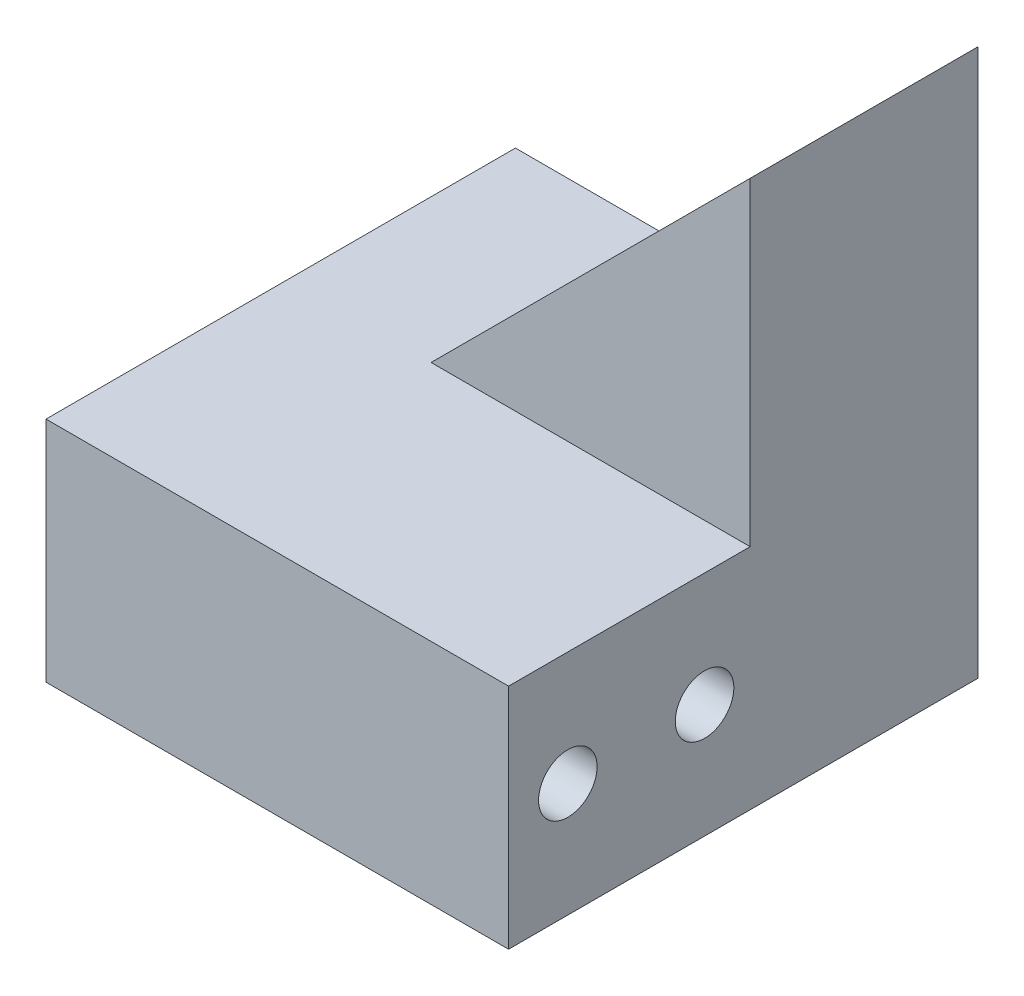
ISO-10303-21;
HEADER;
FILE_DESCRIPTION(('STEP AP214'),'2;1');
FILE_NAME('part.step','',(''),(''),'','','');
FILE_SCHEMA(('AUTOMOTIVE_DESIGN { 1 0 10303 214 1 1 1 1 }'));
ENDSEC;
DATA;
#1=APPLICATION_CONTEXT('core data for automotive mechanical design processes');
#2=APPLICATION_PROTOCOL_DEFINITION('international standard','automotive_design',2000,#1);
#3=PRODUCT_CONTEXT('',#1,'mechanical');
#4=PRODUCT('Part','Part','',(#3));
#5=PRODUCT_RELATED_PRODUCT_CATEGORY('part','',(#4));
#6=PRODUCT_DEFINITION_FORMATION('','',#4);
#7=PRODUCT_DEFINITION_CONTEXT('part definition',#1,'design');
#8=PRODUCT_DEFINITION('design','',#6,#7);
#9=PRODUCT_DEFINITION_SHAPE('','',#8);
#10=(LENGTH_UNIT() NAMED_UNIT(*) SI_UNIT(.MILLI.,.METRE.));
#11=(NAMED_UNIT(*) PLANE_ANGLE_UNIT() SI_UNIT($,.RADIAN.));
#12=(NAMED_UNIT(*) SI_UNIT($,.STERADIAN.) SOLID_ANGLE_UNIT());
#13=UNCERTAINTY_MEASURE_WITH_UNIT(LENGTH_MEASURE(1.E-05),#10,'distance_accuracy_value','');
#14=(GEOMETRIC_REPRESENTATION_CONTEXT(3) GLOBAL_UNCERTAINTY_ASSIGNED_CONTEXT((#13)) GLOBAL_UNIT_ASSIGNED_CONTEXT((#10,
#11,#12)) REPRESENTATION_CONTEXT('',''));
#15=CARTESIAN_POINT('',(0.,0.,0.));
#16=DIRECTION('',(0.,0.,1.));
#17=DIRECTION('',(1.,0.,0.));
#18=AXIS2_PLACEMENT_3D('',#15,#16,#17);
#19=CARTESIAN_POINT('',(-12.674816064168,30.48,-16.5538373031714));
#20=DIRECTION('',(-1.,0.,0.));
#21=DIRECTION('',(0.,0.,1.));
#22=AXIS2_PLACEMENT_3D('',#19,#20,#21);
#23=PLANE('',#22);
#24=CARTESIAN_POINT('',(-12.674816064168,6.35,-1.31383730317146));
#25=DIRECTION('',(-1.,0.,0.));
#26=DIRECTION('',(0.,0.,1.));
#27=AXIS2_PLACEMENT_3D('',#24,#25,#26);
#28=CIRCLE('',#27,1.63194999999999);
#29=CARTESIAN_POINT('',(-12.674816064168,6.35,0.318112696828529));
#30=VERTEX_POINT('',#29);
#31=EDGE_CURVE('E176',#30,#30,#28,.T.);
#32=ORIENTED_EDGE('',*,*,#31,.T.);
#33=EDGE_LOOP('',(#32));
#34=FACE_BOUND('',#33,.T.);
#35=CARTESIAN_POINT('',(-12.674816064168,6.35,6.30616269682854));
#36=DIRECTION('',(-1.,0.,0.));
#37=DIRECTION('',(0.,0.,1.));
#38=AXIS2_PLACEMENT_3D('',#35,#36,#37);
#39=CIRCLE('',#38,1.63194999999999);
#40=CARTESIAN_POINT('',(-12.674816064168,6.35,7.93811269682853));
#41=VERTEX_POINT('',#40);
#42=EDGE_CURVE('E114',#41,#41,#39,.T.);
#43=ORIENTED_EDGE('',*,*,#42,.T.);
#44=EDGE_LOOP('',(#43));
#45=FACE_BOUND('',#44,.T.);
#46=DIRECTION('',(0.,0.,1.));
#47=VECTOR('',#46,1.);
#48=CARTESIAN_POINT('',(-12.674816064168,12.7,-16.5538373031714));
#49=LINE('',#48,#47);
#50=CARTESIAN_POINT('',(-12.674816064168,12.7,-3.85383730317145));
#51=VERTEX_POINT('',#50);
#52=CARTESIAN_POINT('',(-12.674816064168,12.7,9.60816269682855));
#53=VERTEX_POINT('',#52);
#54=EDGE_CURVE('E11',#51,#53,#49,.T.);
#55=ORIENTED_EDGE('',*,*,#54,.T.);
#56=DIRECTION('',(0.,-1.,0.));
#57=VECTOR('',#56,1.);
#58=CARTESIAN_POINT('',(-12.674816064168,12.7,9.60816269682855));
#59=LINE('',#58,#57);
#60=CARTESIAN_POINT('',(-12.674816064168,0.,9.60816269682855));
#61=VERTEX_POINT('',#60);
#62=EDGE_CURVE('E52',#53,#61,#59,.T.);
#63=ORIENTED_EDGE('',*,*,#62,.T.);
#64=DIRECTION('',(0.,0.,-1.));
#65=VECTOR('',#64,1.);
#66=CARTESIAN_POINT('',(-12.674816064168,0.,-16.5538373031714));
#67=LINE('',#66,#65);
#68=CARTESIAN_POINT('',(-12.674816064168,0.,-16.5538373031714));
#69=VERTEX_POINT('',#68);
#70=EDGE_CURVE('E59',#61,#69,#67,.T.);
#71=ORIENTED_EDGE('',*,*,#70,.T.);
#72=DIRECTION('',(0.,-1.,0.));
#73=VECTOR('',#72,1.);
#74=CARTESIAN_POINT('',(-12.674816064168,30.48,-16.5538373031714));
#75=LINE('',#74,#73);
#76=CARTESIAN_POINT('',(-12.674816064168,30.48,-16.5538373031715));
#77=VERTEX_POINT('',#76);
#78=EDGE_CURVE('E44',#77,#69,#75,.T.);
#79=ORIENTED_EDGE('',*,*,#78,.F.);
#80=DIRECTION('',(0.,0.,-1.));
#81=VECTOR('',#80,1.);
#82=CARTESIAN_POINT('',(-12.674816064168,30.48,-16.5538373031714));
#83=LINE('',#82,#81);
#84=CARTESIAN_POINT('',(-12.674816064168,30.48,-3.85383730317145));
#85=VERTEX_POINT('',#84);
#86=EDGE_CURVE('E99',#85,#77,#83,.T.);
#87=ORIENTED_EDGE('',*,*,#86,.F.);
#88=DIRECTION('',(0.,1.,0.));
#89=VECTOR('',#88,1.);
#90=CARTESIAN_POINT('',(-12.674816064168,30.48,-3.85383730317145));
#91=LINE('',#90,#89);
#92=EDGE_CURVE('E134',#51,#85,#91,.T.);
#93=ORIENTED_EDGE('',*,*,#92,.F.);
#94=EDGE_LOOP('',(#55,#63,#71,#79,#87,#93));
#95=FACE_BOUND('',#94,.T.);
#96=ADVANCED_FACE('F36',(#34,#45,#95),#23,.F.);
#97=CARTESIAN_POINT('',(-30.454816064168,30.48,-16.5538373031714));
#98=DIRECTION('',(0.,0.,1.));
#99=DIRECTION('',(1.,0.,0.));
#100=AXIS2_PLACEMENT_3D('',#97,#98,#99);
#101=PLANE('',#100);
#102=DIRECTION('',(-1.,0.,0.));
#103=VECTOR('',#102,1.);
#104=CARTESIAN_POINT('',(-30.454816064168,0.,-16.5538373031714));
#105=LINE('',#104,#103);
#106=CARTESIAN_POINT('',(-38.454816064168,0.,-16.5538373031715));
#107=VERTEX_POINT('',#106);
#108=EDGE_CURVE('E91',#69,#107,#105,.T.);
#109=ORIENTED_EDGE('',*,*,#108,.T.);
#110=DIRECTION('',(0.,-1.,0.));
#111=VECTOR('',#110,1.);
#112=CARTESIAN_POINT('',(-38.454816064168,12.7,-16.5538373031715));
#113=LINE('',#112,#111);
#114=CARTESIAN_POINT('',(-38.454816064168,12.7,-16.5538373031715));
#115=VERTEX_POINT('',#114);
#116=EDGE_CURVE('E96',#115,#107,#113,.T.);
#117=ORIENTED_EDGE('',*,*,#116,.F.);
#118=DIRECTION('',(1.,0.,0.));
#119=VECTOR('',#118,1.);
#120=CARTESIAN_POINT('',(-38.454816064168,12.7,-16.5538373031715));
#121=LINE('',#120,#119);
#122=CARTESIAN_POINT('',(-30.454816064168,12.7,-16.5538373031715));
#123=VERTEX_POINT('',#122);
#124=EDGE_CURVE('E123',#115,#123,#121,.T.);
#125=ORIENTED_EDGE('',*,*,#124,.T.);
#126=DIRECTION('',(0.707106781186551,0.707106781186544,0.));
#127=VECTOR('',#126,1.);
#128=CARTESIAN_POINT('',(-21.564816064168,21.5899999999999,-16.5538373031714));
#129=LINE('',#128,#127);
#130=EDGE_CURVE('E130',#123,#77,#129,.T.);
#131=ORIENTED_EDGE('',*,*,#130,.T.);
#132=ORIENTED_EDGE('',*,*,#78,.T.);
#133=EDGE_LOOP('',(#109,#117,#125,#131,#132));
#134=FACE_BOUND('',#133,.T.);
#135=ADVANCED_FACE('F93',(#134),#101,.F.);
#136=CARTESIAN_POINT('',(0.,0.,0.));
#137=DIRECTION('',(0.,1.,0.));
#138=DIRECTION('',(0.,0.,1.));
#139=AXIS2_PLACEMENT_3D('',#136,#137,#138);
#140=PLANE('',#139);
#141=ORIENTED_EDGE('',*,*,#70,.F.);
#142=DIRECTION('',(-1.,0.,0.));
#143=VECTOR('',#142,1.);
#144=CARTESIAN_POINT('',(-12.674816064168,0.,9.60816269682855));
#145=LINE('',#144,#143);
#146=CARTESIAN_POINT('',(-38.454816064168,0.,9.60816269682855));
#147=VERTEX_POINT('',#146);
#148=EDGE_CURVE('E104',#61,#147,#145,.T.);
#149=ORIENTED_EDGE('',*,*,#148,.T.);
#150=DIRECTION('',(0.,0.,1.));
#151=VECTOR('',#150,1.);
#152=CARTESIAN_POINT('',(-38.454816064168,0.,-16.5538373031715));
#153=LINE('',#152,#151);
#154=EDGE_CURVE('E102',#107,#147,#153,.T.);
#155=ORIENTED_EDGE('',*,*,#154,.F.);
#156=ORIENTED_EDGE('',*,*,#108,.F.);
#157=EDGE_LOOP('',(#141,#149,#155,#156));
#158=FACE_BOUND('',#157,.T.);
#159=ADVANCED_FACE('F103',(#158),#140,.F.);
#160=CARTESIAN_POINT('',(0.0251839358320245,12.7,0.));
#161=DIRECTION('',(0.,-1.,0.));
#162=DIRECTION('',(0.,0.,-1.));
#163=AXIS2_PLACEMENT_3D('',#160,#161,#162);
#164=PLANE('',#163);
#165=DIRECTION('',(-1.,0.,0.));
#166=VECTOR('',#165,1.);
#167=CARTESIAN_POINT('',(0.0251839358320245,12.7,-3.85383730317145));
#168=LINE('',#167,#166);
#169=CARTESIAN_POINT('',(-30.454816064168,12.7,-3.85383730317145));
#170=VERTEX_POINT('',#169);
#171=EDGE_CURVE('E132',#51,#170,#168,.T.);
#172=ORIENTED_EDGE('',*,*,#171,.T.);
#173=DIRECTION('',(0.,0.,1.));
#174=VECTOR('',#173,1.);
#175=CARTESIAN_POINT('',(-30.454816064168,12.7,-34.3338373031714));
#176=LINE('',#175,#174);
#177=EDGE_CURVE('E133',#123,#170,#176,.T.);
#178=ORIENTED_EDGE('',*,*,#177,.F.);
#179=ORIENTED_EDGE('',*,*,#124,.F.);
#180=DIRECTION('',(0.,0.,-1.));
#181=VECTOR('',#180,1.);
#182=CARTESIAN_POINT('',(-38.454816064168,12.7,-16.5538373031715));
#183=LINE('',#182,#181);
#184=CARTESIAN_POINT('',(-38.454816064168,12.7,9.60816269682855));
#185=VERTEX_POINT('',#184);
#186=EDGE_CURVE('E112',#185,#115,#183,.T.);
#187=ORIENTED_EDGE('',*,*,#186,.F.);
#188=DIRECTION('',(-1.,0.,0.));
#189=VECTOR('',#188,1.);
#190=CARTESIAN_POINT('',(-12.674816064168,12.7,9.60816269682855));
#191=LINE('',#190,#189);
#192=EDGE_CURVE('E126',#53,#185,#191,.T.);
#193=ORIENTED_EDGE('',*,*,#192,.F.);
#194=ORIENTED_EDGE('',*,*,#54,.F.);
#195=EDGE_LOOP('',(#172,#178,#179,#187,#193,#194));
#196=FACE_BOUND('',#195,.T.);
#197=ADVANCED_FACE('F149',(#196),#164,.F.);
#198=CARTESIAN_POINT('',(0.0251839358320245,0.,-3.85383730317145));
#199=DIRECTION('',(0.,0.,1.));
#200=DIRECTION('',(1.,0.,0.));
#201=AXIS2_PLACEMENT_3D('',#198,#199,#200);
#202=PLANE('',#201);
#203=DIRECTION('',(0.707106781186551,0.707106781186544,0.));
#204=VECTOR('',#203,1.);
#205=CARTESIAN_POINT('',(-21.5774080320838,21.5774080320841,-3.85383730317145));
#206=LINE('',#205,#204);
#207=EDGE_CURVE('E128',#170,#85,#206,.T.);
#208=ORIENTED_EDGE('',*,*,#207,.F.);
#209=ORIENTED_EDGE('',*,*,#171,.F.);
#210=ORIENTED_EDGE('',*,*,#92,.T.);
#211=EDGE_LOOP('',(#208,#209,#210));
#212=FACE_BOUND('',#211,.T.);
#213=ADVANCED_FACE('F153',(#212),#202,.T.);
#214=CARTESIAN_POINT('',(-21.5774080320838,21.5774080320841,-34.3338373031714));
#215=DIRECTION('',(0.707106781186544,-0.707106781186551,0.));
#216=DIRECTION('',(0.707106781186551,0.707106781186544,0.));
#217=AXIS2_PLACEMENT_3D('',#214,#215,#216);
#218=PLANE('',#217);
#219=ORIENTED_EDGE('',*,*,#177,.T.);
#220=ORIENTED_EDGE('',*,*,#207,.T.);
#221=ORIENTED_EDGE('',*,*,#86,.T.);
#222=ORIENTED_EDGE('',*,*,#130,.F.);
#223=EDGE_LOOP('',(#219,#220,#221,#222));
#224=FACE_BOUND('',#223,.T.);
#225=ADVANCED_FACE('F156',(#224),#218,.F.);
#226=CARTESIAN_POINT('',(-12.674816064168,12.7,9.60816269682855));
#227=DIRECTION('',(0.,0.,-1.));
#228=DIRECTION('',(-1.,0.,0.));
#229=AXIS2_PLACEMENT_3D('',#226,#227,#228);
#230=PLANE('',#229);
#231=ORIENTED_EDGE('',*,*,#192,.T.);
#232=DIRECTION('',(0.,1.,0.));
#233=VECTOR('',#232,1.);
#234=CARTESIAN_POINT('',(-38.454816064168,12.7,9.60816269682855));
#235=LINE('',#234,#233);
#236=EDGE_CURVE('E108',#147,#185,#235,.T.);
#237=ORIENTED_EDGE('',*,*,#236,.F.);
#238=ORIENTED_EDGE('',*,*,#148,.F.);
#239=ORIENTED_EDGE('',*,*,#62,.F.);
#240=EDGE_LOOP('',(#231,#237,#238,#239));
#241=FACE_BOUND('',#240,.T.);
#242=ADVANCED_FACE('F157',(#241),#230,.F.);
#243=CARTESIAN_POINT('',(-38.454816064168,0.,0.));
#244=DIRECTION('',(-1.,0.,0.));
#245=DIRECTION('',(0.,0.,1.));
#246=AXIS2_PLACEMENT_3D('',#243,#244,#245);
#247=PLANE('',#246);
#248=CARTESIAN_POINT('',(-38.454816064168,6.35,-1.31383730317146));
#249=DIRECTION('',(-1.,0.,0.));
#250=DIRECTION('',(0.,0.,1.));
#251=AXIS2_PLACEMENT_3D('',#248,#249,#250);
#252=CIRCLE('',#251,1.63194999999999);
#253=CARTESIAN_POINT('',(-38.454816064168,6.35,0.318112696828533));
#254=VERTEX_POINT('',#253);
#255=EDGE_CURVE('E191',#254,#254,#252,.T.);
#256=ORIENTED_EDGE('',*,*,#255,.F.);
#257=EDGE_LOOP('',(#256));
#258=FACE_BOUND('',#257,.T.);
#259=CARTESIAN_POINT('',(-38.454816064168,6.35,6.30616269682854));
#260=DIRECTION('',(-1.,0.,0.));
#261=DIRECTION('',(0.,0.,1.));
#262=AXIS2_PLACEMENT_3D('',#259,#260,#261);
#263=CIRCLE('',#262,1.63194999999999);
#264=CARTESIAN_POINT('',(-38.454816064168,6.35,7.93811269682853));
#265=VERTEX_POINT('',#264);
#266=EDGE_CURVE('E117',#265,#265,#263,.T.);
#267=ORIENTED_EDGE('',*,*,#266,.F.);
#268=EDGE_LOOP('',(#267));
#269=FACE_BOUND('',#268,.T.);
#270=ORIENTED_EDGE('',*,*,#116,.T.);
#271=ORIENTED_EDGE('',*,*,#154,.T.);
#272=ORIENTED_EDGE('',*,*,#236,.T.);
#273=ORIENTED_EDGE('',*,*,#186,.T.);
#274=EDGE_LOOP('',(#270,#271,#272,#273));
#275=FACE_BOUND('',#274,.T.);
#276=ADVANCED_FACE('F110',(#258,#269,#275),#247,.T.);
#277=CARTESIAN_POINT('',(-38.454816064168,6.35,6.30616269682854));
#278=DIRECTION('',(-1.,0.,0.));
#279=DIRECTION('',(0.,0.,1.));
#280=AXIS2_PLACEMENT_3D('',#277,#278,#279);
#281=CYLINDRICAL_SURFACE('',#280,1.63194999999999);
#282=ORIENTED_EDGE('',*,*,#266,.T.);
#283=EDGE_LOOP('',(#282));
#284=FACE_BOUND('',#283,.T.);
#285=ORIENTED_EDGE('',*,*,#42,.F.);
#286=EDGE_LOOP('',(#285));
#287=FACE_BOUND('',#286,.T.);
#288=ADVANCED_FACE('F164',(#284,#287),#281,.F.);
#289=CARTESIAN_POINT('',(-38.454816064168,6.35,-1.31383730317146));
#290=DIRECTION('',(-1.,0.,0.));
#291=DIRECTION('',(0.,0.,1.));
#292=AXIS2_PLACEMENT_3D('',#289,#290,#291);
#293=CYLINDRICAL_SURFACE('',#292,1.63194999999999);
#294=ORIENTED_EDGE('',*,*,#255,.T.);
#295=EDGE_LOOP('',(#294));
#296=FACE_BOUND('',#295,.T.);
#297=ORIENTED_EDGE('',*,*,#31,.F.);
#298=EDGE_LOOP('',(#297));
#299=FACE_BOUND('',#298,.T.);
#300=ADVANCED_FACE('F180',(#296,#299),#293,.F.);
#301=CLOSED_SHELL('',(#96,#135,#159,#197,#213,#225,#242,#276,#288,#300));
#302=MANIFOLD_SOLID_BREP('B2',#301);
#303=ADVANCED_BREP_SHAPE_REPRESENTATION('',(#18,#302),#14);
#304=SHAPE_DEFINITION_REPRESENTATION(#9,#303);
ENDSEC;
END-ISO-10303-21;
